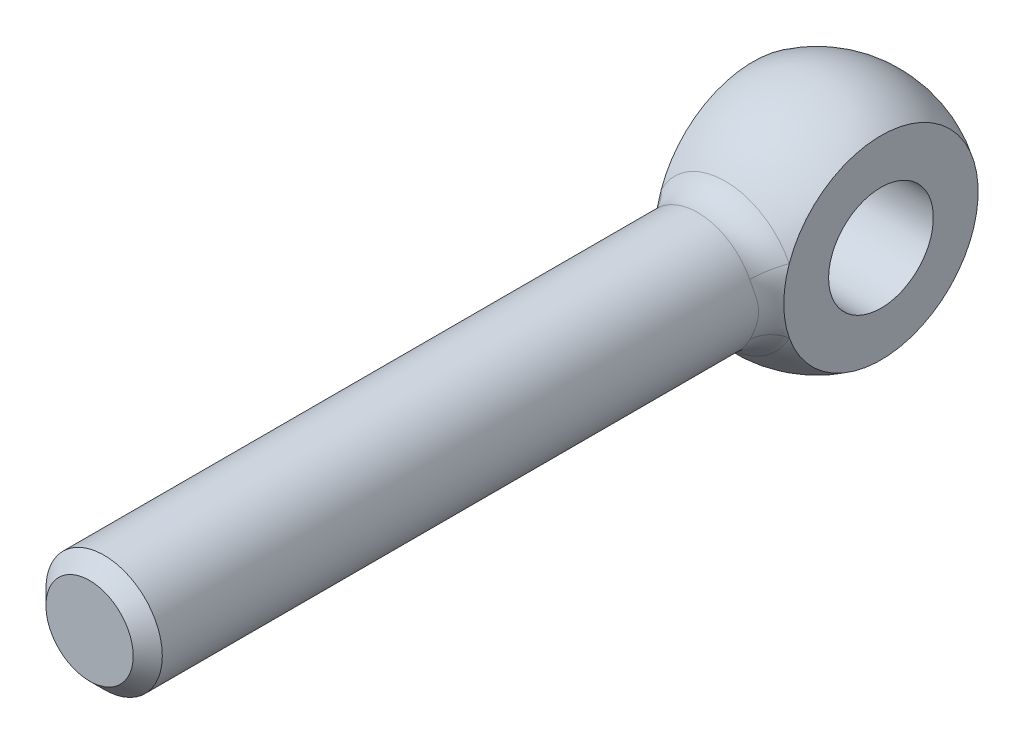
ISO-10303-21;
HEADER;
FILE_DESCRIPTION(('STEP AP214'),'2;1');
FILE_NAME('part.step','',(''),(''),'','','');
FILE_SCHEMA(('AUTOMOTIVE_DESIGN { 1 0 10303 214 1 1 1 1 }'));
ENDSEC;
DATA;
#1=APPLICATION_CONTEXT('core data for automotive mechanical design processes');
#2=APPLICATION_PROTOCOL_DEFINITION('international standard','automotive_design',2000,#1);
#3=PRODUCT_CONTEXT('',#1,'mechanical');
#4=PRODUCT('Part','Part','',(#3));
#5=PRODUCT_RELATED_PRODUCT_CATEGORY('part','',(#4));
#6=PRODUCT_DEFINITION_FORMATION('','',#4);
#7=PRODUCT_DEFINITION_CONTEXT('part definition',#1,'design');
#8=PRODUCT_DEFINITION('design','',#6,#7);
#9=PRODUCT_DEFINITION_SHAPE('','',#8);
#10=(LENGTH_UNIT() NAMED_UNIT(*) SI_UNIT(.MILLI.,.METRE.));
#11=(NAMED_UNIT(*) PLANE_ANGLE_UNIT() SI_UNIT($,.RADIAN.));
#12=(NAMED_UNIT(*) SI_UNIT($,.STERADIAN.) SOLID_ANGLE_UNIT());
#13=UNCERTAINTY_MEASURE_WITH_UNIT(LENGTH_MEASURE(1.E-05),#10,'distance_accuracy_value','');
#14=(GEOMETRIC_REPRESENTATION_CONTEXT(3) GLOBAL_UNCERTAINTY_ASSIGNED_CONTEXT((#13)) GLOBAL_UNIT_ASSIGNED_CONTEXT((#10,
#11,#12)) REPRESENTATION_CONTEXT('',''));
#15=CARTESIAN_POINT('',(0.,0.,0.));
#16=DIRECTION('',(0.,0.,1.));
#17=DIRECTION('',(1.,0.,0.));
#18=AXIS2_PLACEMENT_3D('',#15,#16,#17);
#19=CARTESIAN_POINT('',(0.,0.,0.));
#20=DIRECTION('',(-1.,0.,0.));
#21=DIRECTION('',(0.,0.,-1.));
#22=AXIS2_PLACEMENT_3D('',#19,#20,#21);
#23=SPHERICAL_SURFACE('',#22,20.);
#24=CARTESIAN_POINT('',(11.,0.,0.));
#25=DIRECTION('',(1.,0.,0.));
#26=DIRECTION('',(0.,0.,1.));
#27=AXIS2_PLACEMENT_3D('',#24,#25,#26);
#28=CIRCLE('',#27,16.70329308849);
#29=CARTESIAN_POINT('',(11.,5.52080518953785,15.7645396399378));
#30=VERTEX_POINT('',#29);
#31=CARTESIAN_POINT('',(11.,-5.52080518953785,15.7645396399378));
#32=VERTEX_POINT('',#31);
#33=EDGE_CURVE('E249',#30,#32,#28,.F.);
#34=ORIENTED_EDGE('',*,*,#33,.T.);
#35=CARTESIAN_POINT('',(0.,0.,15.7645396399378));
#36=DIRECTION('',(0.,0.,-1.));
#37=DIRECTION('',(-1.,0.,0.));
#38=AXIS2_PLACEMENT_3D('',#35,#36,#37);
#39=CIRCLE('',#38,12.3076923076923);
#40=CARTESIAN_POINT('',(-11.,-5.52080518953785,15.7645396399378));
#41=VERTEX_POINT('',#40);
#42=EDGE_CURVE('E72',#32,#41,#39,.T.);
#43=ORIENTED_EDGE('',*,*,#42,.T.);
#44=CARTESIAN_POINT('',(-11.,0.,0.));
#45=DIRECTION('',(1.,0.,0.));
#46=DIRECTION('',(0.,0.,1.));
#47=AXIS2_PLACEMENT_3D('',#44,#45,#46);
#48=CIRCLE('',#47,16.70329308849);
#49=CARTESIAN_POINT('',(-11.,5.52080518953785,15.7645396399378));
#50=VERTEX_POINT('',#49);
#51=EDGE_CURVE('E60',#50,#41,#48,.F.);
#52=ORIENTED_EDGE('',*,*,#51,.F.);
#53=CARTESIAN_POINT('',(0.,0.,15.7645396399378));
#54=DIRECTION('',(0.,0.,-1.));
#55=DIRECTION('',(-1.,0.,0.));
#56=AXIS2_PLACEMENT_3D('',#53,#54,#55);
#57=CIRCLE('',#56,12.3076923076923);
#58=EDGE_CURVE('E69',#50,#30,#57,.T.);
#59=ORIENTED_EDGE('',*,*,#58,.T.);
#60=EDGE_LOOP('',(#34,#43,#52,#59));
#61=FACE_BOUND('',#60,.T.);
#62=ADVANCED_FACE('F14',(#61),#23,.T.);
#63=CARTESIAN_POINT('',(0.,0.,-10.));
#64=DIRECTION('',(0.,0.,-1.));
#65=DIRECTION('',(1.,0.,0.));
#66=AXIS2_PLACEMENT_3D('',#63,#64,#65);
#67=CYLINDRICAL_SURFACE('',#66,10.);
#68=CARTESIAN_POINT('',(11.,8.07832617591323,14.6198716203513));
#69=CARTESIAN_POINT('',(8.08765754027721,5.99719772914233,16.1346741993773));
#70=CARTESIAN_POINT('',(7.28375150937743,6.85178545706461,19.8401938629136));
#71=CARTESIAN_POINT('',(11.,7.94371142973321,14.6942392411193));
#72=CARTESIAN_POINT('',(8.11920288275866,5.93544807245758,16.2397825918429));
#73=CARTESIAN_POINT('',(7.39683409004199,6.73162150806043,19.9238227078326));
#74=CARTESIAN_POINT('',(11.,7.80678494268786,14.7674864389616));
#75=CARTESIAN_POINT('',(8.15519367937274,5.8698319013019,16.3423149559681));
#76=CARTESIAN_POINT('',(7.50807818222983,6.60735770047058,19.9985173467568));
#77=CARTESIAN_POINT('',(11.,7.52777859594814,14.9116503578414));
#78=CARTESIAN_POINT('',(8.23492168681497,5.72986071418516,16.5404699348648));
#79=CARTESIAN_POINT('',(7.72578328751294,6.35140245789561,20.1309394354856));
#80=CARTESIAN_POINT('',(11.,7.38570047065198,14.9825678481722));
#81=CARTESIAN_POINT('',(8.27858235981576,5.65560014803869,16.6361171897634));
#82=CARTESIAN_POINT('',(7.83224588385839,6.21971351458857,20.1886725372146));
#83=CARTESIAN_POINT('',(11.,7.09641260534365,15.1217242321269));
#84=CARTESIAN_POINT('',(8.37244720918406,5.4973859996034,16.8193360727));
#85=CARTESIAN_POINT('',(8.03890108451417,5.95019585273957,20.2879075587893));
#86=CARTESIAN_POINT('',(11.,6.94922832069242,15.1899735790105));
#87=CARTESIAN_POINT('',(8.42255486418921,5.41357855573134,16.9069775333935));
#88=CARTESIAN_POINT('',(8.1391193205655,5.81239684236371,20.3294800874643));
#89=CARTESIAN_POINT('',(11.,6.64863682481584,15.3239259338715));
#90=CARTESIAN_POINT('',(8.52797993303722,5.23504745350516,17.0738797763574));
#91=CARTESIAN_POINT('',(8.33295854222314,5.53091179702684,20.3979224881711));
#92=CARTESIAN_POINT('',(11.,6.49523086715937,15.3896294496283));
#93=CARTESIAN_POINT('',(8.58324700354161,5.14042645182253,17.1531990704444));
#94=CARTESIAN_POINT('',(8.42658084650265,5.38722694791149,20.4247953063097));
#95=CARTESIAN_POINT('',(11.,6.20709411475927,15.5078088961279));
#96=CARTESIAN_POINT('',(8.68811994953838,4.95575537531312,17.2908288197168));
#97=CARTESIAN_POINT('',(8.59200338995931,5.11841729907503,20.4619167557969));
#98=CARTESIAN_POINT('',(11.,6.07336532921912,15.5607030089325));
#99=CARTESIAN_POINT('',(8.73711538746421,4.86761224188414,17.3504312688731));
#100=CARTESIAN_POINT('',(8.66488139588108,4.99405789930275,20.4741536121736));
#101=CARTESIAN_POINT('',(11.,5.80091130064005,15.6643118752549));
#102=CARTESIAN_POINT('',(8.83647568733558,4.68301353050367,17.4631108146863));
#103=CARTESIAN_POINT('',(8.80526889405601,4.74215537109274,20.4901477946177));
#104=CARTESIAN_POINT('',(11.,5.66218619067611,15.7150266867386));
#105=CARTESIAN_POINT('',(8.88683503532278,4.58660687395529,17.5162358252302));
#106=CARTESIAN_POINT('',(8.87277852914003,4.61461232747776,20.4939053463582));
#107=CARTESIAN_POINT('',(11.,5.2744874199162,15.8508024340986));
#108=CARTESIAN_POINT('',(9.02498244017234,4.31134076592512,17.6524759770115));
#109=CARTESIAN_POINT('',(9.05025948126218,4.26097993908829,20.4938948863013));
#110=CARTESIAN_POINT('',(11.,5.02010807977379,15.933417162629));
#111=CARTESIAN_POINT('',(9.1134168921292,4.12339116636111,17.7293699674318));
#112=CARTESIAN_POINT('',(9.15455589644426,4.03201043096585,20.482471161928));
#113=CARTESIAN_POINT('',(11.,4.49398867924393,16.0897301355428));
#114=CARTESIAN_POINT('',(9.2852606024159,3.7225223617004,17.8631716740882));
#115=CARTESIAN_POINT('',(9.3454636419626,3.56728408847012,20.4426249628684));
#116=CARTESIAN_POINT('',(11.,4.22223625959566,16.1634219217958));
#117=CARTESIAN_POINT('',(9.36879764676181,3.50966167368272,17.9203351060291));
#118=CARTESIAN_POINT('',(9.43206219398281,3.33152248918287,20.4141902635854));
#119=CARTESIAN_POINT('',(11.,3.65988605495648,16.2999751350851));
#120=CARTESIAN_POINT('',(9.52556401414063,3.06031940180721,18.0164117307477));
#121=CARTESIAN_POINT('',(9.58737307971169,2.8540318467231,20.3472388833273));
#122=CARTESIAN_POINT('',(11.,3.36923757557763,16.3628056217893));
#123=CARTESIAN_POINT('',(9.59896836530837,2.82367795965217,18.055508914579));
#124=CARTESIAN_POINT('',(9.65603459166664,2.61228792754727,20.3086941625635));
#125=CARTESIAN_POINT('',(11.,2.76973253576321,16.47487160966));
#126=CARTESIAN_POINT('',(9.7303273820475,2.33005694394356,18.1181298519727));
#127=CARTESIAN_POINT('',(9.77497001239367,2.12438390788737,20.2300406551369));
#128=CARTESIAN_POINT('',(11.,2.46087520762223,16.5241065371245));
#129=CARTESIAN_POINT('',(9.78851479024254,2.07279105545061,18.1418261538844));
#130=CARTESIAN_POINT('',(9.82524314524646,1.87822362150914,20.1899318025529));
#131=CARTESIAN_POINT('',(11.,1.97558099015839,16.5869215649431));
#132=CARTESIAN_POINT('',(9.8627242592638,1.66606653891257,18.1691299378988));
#133=CARTESIAN_POINT('',(9.88798469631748,1.49853407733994,20.1346921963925));
#134=CARTESIAN_POINT('',(11.,1.80486836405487,16.6064011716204));
#135=CARTESIAN_POINT('',(9.88572783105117,1.52271728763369,18.1769526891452));
#136=CARTESIAN_POINT('',(9.90713175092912,1.36624599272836,20.1166604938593));
#137=CARTESIAN_POINT('',(11.,1.45962748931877,16.6402989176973));
#138=CARTESIAN_POINT('',(9.92572316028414,1.2323607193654,18.1898667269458));
#139=CARTESIAN_POINT('',(9.94012224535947,1.1008390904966,20.0843097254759));
#140=CARTESIAN_POINT('',(11.,1.28509972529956,16.6547176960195));
#141=CARTESIAN_POINT('',(9.94274289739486,1.08526382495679,18.194968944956));
#142=CARTESIAN_POINT('',(9.95396635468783,0.967720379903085,20.0699901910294));
#143=CARTESIAN_POINT('',(11.,0.933265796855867,16.6781317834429));
#144=CARTESIAN_POINT('',(9.97034914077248,0.788518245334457,18.2029399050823));
#145=CARTESIAN_POINT('',(9.97630347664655,0.70091512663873,20.0463030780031));
#146=CARTESIAN_POINT('',(11.,0.755960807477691,16.6871293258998));
#147=CARTESIAN_POINT('',(9.98095837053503,0.638767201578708,18.2058159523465));
#148=CARTESIAN_POINT('',(9.98479869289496,0.567228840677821,20.0369334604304));
#149=CARTESIAN_POINT('',(11.,0.399779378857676,16.6994587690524));
#150=CARTESIAN_POINT('',(9.99548246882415,0.337908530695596,18.20969285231));
#151=CARTESIAN_POINT('',(9.99641148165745,0.299512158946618,20.024007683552));
#152=CARTESIAN_POINT('',(11.,0.220902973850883,16.7027907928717));
#153=CARTESIAN_POINT('',(9.99940850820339,0.186688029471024,18.2106967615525));
#154=CARTESIAN_POINT('',(9.99952917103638,0.165481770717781,20.0204513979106));
#155=CARTESIAN_POINT('',(11.,-0.136946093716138,16.7036898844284));
#156=CARTESIAN_POINT('',(10.0004672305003,-0.115727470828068,18.2109707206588));
#157=CARTESIAN_POINT('',(10.0003719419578,-0.102589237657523,20.0194964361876));
#158=CARTESIAN_POINT('',(11.,-0.315918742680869,16.7012576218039));
#159=CARTESIAN_POINT('',(9.99760151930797,-0.26703906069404,18.2102411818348));
#160=CARTESIAN_POINT('',(9.9980976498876,-0.236629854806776,20.0220970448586));
#161=CARTESIAN_POINT('',(11.,-0.672512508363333,16.6907025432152));
#162=CARTESIAN_POINT('',(9.98516890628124,-0.568286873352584,18.2069499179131));
#163=CARTESIAN_POINT('',(9.98816894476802,-0.504415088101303,20.0332017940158));
#164=CARTESIAN_POINT('',(11.,-0.850133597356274,16.6825796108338));
#165=CARTESIAN_POINT('',(9.97559239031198,-0.718336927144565,18.2043856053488));
#166=CARTESIAN_POINT('',(9.98051442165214,-0.638159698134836,20.0417060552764));
#167=CARTESIAN_POINT('',(11.,-1.20278271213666,16.6608685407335));
#168=CARTESIAN_POINT('',(9.94999783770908,-1.01586252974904,18.1971047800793));
#169=CARTESIAN_POINT('',(9.95985376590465,-0.905121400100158,20.063826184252));
#170=CARTESIAN_POINT('',(11.,-1.37780963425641,16.6472781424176));
#171=CARTESIAN_POINT('',(9.93395835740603,-1.16344227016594,18.1923815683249));
#172=CARTESIAN_POINT('',(9.94684541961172,-1.03833825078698,20.0774441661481));
#173=CARTESIAN_POINT('',(11.,-1.72418294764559,16.6149773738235));
#174=CARTESIAN_POINT('',(9.89585032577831,-1.45491369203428,18.1803094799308));
#175=CARTESIAN_POINT('',(9.91552061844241,-1.3039715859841,20.1086007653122));
#176=CARTESIAN_POINT('',(11.,-1.89552887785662,16.5962663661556));
#177=CARTESIAN_POINT('',(9.87375477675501,-1.59889725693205,18.1729504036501));
#178=CARTESIAN_POINT('',(9.89720350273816,-1.43638796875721,20.1261398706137));
#179=CARTESIAN_POINT('',(11.,-2.37500909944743,16.5365375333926));
#180=CARTESIAN_POINT('',(9.80319058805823,-2.00106700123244,18.1475319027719));
#181=CARTESIAN_POINT('',(9.83780774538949,-1.81042123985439,20.1794292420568));
#182=CARTESIAN_POINT('',(11.,-2.6779072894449,16.4899385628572));
#183=CARTESIAN_POINT('',(9.74810406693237,-2.25372442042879,18.1256509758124));
#184=CARTESIAN_POINT('',(9.79049373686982,-2.0509057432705,20.2181580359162));
#185=CARTESIAN_POINT('',(11.,-3.26643445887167,16.3835279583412));
#186=CARTESIAN_POINT('',(9.62321822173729,-2.7394442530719,18.0677502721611));
#187=CARTESIAN_POINT('',(9.67835774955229,-2.52772088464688,20.2950790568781));
#188=CARTESIAN_POINT('',(11.,-3.55206644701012,16.3237186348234));
#189=CARTESIAN_POINT('',(9.55320446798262,-2.97279590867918,18.0315791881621));
#190=CARTESIAN_POINT('',(9.61353883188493,-2.7640522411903,20.333271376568));
#191=CARTESIAN_POINT('',(11.,-4.10520079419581,16.1934500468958));
#192=CARTESIAN_POINT('',(9.40307308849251,-3.41694854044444,17.9425152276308));
#193=CARTESIAN_POINT('',(9.46676566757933,-3.23111087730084,20.4009956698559));
#194=CARTESIAN_POINT('',(11.,-4.37275328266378,16.1230221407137));
#195=CARTESIAN_POINT('',(9.32279049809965,-3.6279239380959,17.8894603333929));
#196=CARTESIAN_POINT('',(9.38486161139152,-3.4618524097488,20.430552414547));
#197=CARTESIAN_POINT('',(11.,-4.89128593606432,15.9733573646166));
#198=CARTESIAN_POINT('',(9.15681833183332,-4.02651224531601,17.7649594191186));
#199=CARTESIAN_POINT('',(9.20410009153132,-3.91720598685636,20.4744658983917));
#200=CARTESIAN_POINT('',(11.,-5.14226890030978,15.8941219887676));
#201=CARTESIAN_POINT('',(9.07099592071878,-4.21407941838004,17.6932699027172));
#202=CARTESIAN_POINT('',(9.10524550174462,-4.14181906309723,20.4888252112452));
#203=CARTESIAN_POINT('',(11.,-5.57948076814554,15.7452016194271));
#204=CARTESIAN_POINT('',(8.91675575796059,-4.52930004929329,17.5476124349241));
#205=CARTESIAN_POINT('',(8.91288683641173,-4.53858237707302,20.4959451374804));
#206=CARTESIAN_POINT('',(11.,-5.76853191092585,15.6768309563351));
#207=CARTESIAN_POINT('',(8.84816828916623,-4.66157604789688,17.4767712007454));
#208=CARTESIAN_POINT('',(8.82235160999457,-4.71214727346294,20.4924900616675));
#209=CARTESIAN_POINT('',(11.,-6.13738931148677,15.5361317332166));
#210=CARTESIAN_POINT('',(8.71360068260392,-4.91098552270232,17.3233243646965));
#211=CARTESIAN_POINT('',(8.63145758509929,-5.05332990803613,20.4699143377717));
#212=CARTESIAN_POINT('',(11.,-6.31719880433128,15.4638045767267));
#213=CARTESIAN_POINT('',(8.64763428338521,-5.02800230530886,17.2406040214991));
#214=CARTESIAN_POINT('',(8.53110226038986,-5.2209497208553,20.4507992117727));
#215=CARTESIAN_POINT('',(11.,-6.67039350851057,15.3147992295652));
#216=CARTESIAN_POINT('',(8.52017906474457,-5.24885941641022,17.062956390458));
#217=CARTESIAN_POINT('',(8.32005997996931,-5.55115938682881,20.3943977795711));
#218=CARTESIAN_POINT('',(11.,-6.84367796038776,15.2380797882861));
#219=CARTESIAN_POINT('',(8.45881409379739,-5.35236860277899,16.967804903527));
#220=CARTESIAN_POINT('',(8.20926514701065,-5.71366661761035,20.3568998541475));
#221=CARTESIAN_POINT('',(11.,-7.18254092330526,15.0813064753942));
#222=CARTESIAN_POINT('',(8.34361214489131,-5.54600465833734,16.7669351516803));
#223=CARTESIAN_POINT('',(7.97938823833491,-6.03058739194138,20.2617246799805));
#224=CARTESIAN_POINT('',(11.,-7.34810983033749,15.0012486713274));
#225=CARTESIAN_POINT('',(8.28987110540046,-5.63596246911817,16.6611306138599));
#226=CARTESIAN_POINT('',(7.86029627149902,-6.18499087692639,20.2040230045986));
#227=CARTESIAN_POINT('',(11.,-7.51010721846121,14.919728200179));
#228=CARTESIAN_POINT('',(8.24137694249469,-5.71943183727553,16.5511784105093));
#229=CARTESIAN_POINT('',(7.73770382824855,-6.3346617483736,20.1353038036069));
#230=(BOUNDED_SURFACE() B_SPLINE_SURFACE(3,2,((#68,#69,#70),(#71,#72,#73),(#74,#75,#76),(#77,
#78,#79),(#80,#81,#82),(#83,#84,#85),(#86,#87,#88),(#89,#90,#91),(#92,#93,#94),(#95,#96,#97),
(#98,#99,#100),(#101,#102,#103),(#104,#105,#106),(#107,#108,#109),(#110,#111,#112),(#113,#114,
#115),(#116,#117,#118),(#119,#120,#121),(#122,#123,#124),(#125,#126,#127),(#128,#129,#130),
(#131,#132,#133),(#134,#135,#136),(#137,#138,#139),(#140,#141,#142),(#143,#144,#145),(#146,#147,
#148),(#149,#150,#151),(#152,#153,#154),(#155,#156,#157),(#158,#159,#160),(#161,#162,#163),
(#164,#165,#166),(#167,#168,#169),(#170,#171,#172),(#173,#174,#175),(#176,#177,#178),(#179,#180,
#181),(#182,#183,#184),(#185,#186,#187),(#188,#189,#190),(#191,#192,#193),(#194,#195,#196),
(#197,#198,#199),(#200,#201,#202),(#203,#204,#205),(#206,#207,#208),(#209,#210,#211),(#212,#213,
#214),(#215,#216,#217),(#218,#219,#220),(#221,#222,#223),(#224,#225,#226),(#227,#228,#229)),
.UNSPECIFIED.,.F.,.F.,.F.) B_SPLINE_SURFACE_WITH_KNOTS((4,2,2,2,2,2,2,2,2,2,2,2,2,2,2,2,2,2,2,2,
2,2,2,2,2,2,4),(3,3),(0.,0.830487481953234,1.66069791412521,2.48723908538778,3.31361454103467,
4.00607990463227,4.69852683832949,5.90492644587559,7.11219405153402,8.32284604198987,
9.53354911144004,10.1772580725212,10.8208857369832,11.4642480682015,12.1075964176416,
12.7508700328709,13.3941568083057,14.0377098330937,14.6813430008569,15.8623569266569,
17.043164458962,18.2205508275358,19.3977377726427,20.336589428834,21.2751101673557,
22.224698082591,23.1754380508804),(0.,1.),
.UNSPECIFIED.) GEOMETRIC_REPRESENTATION_ITEM() RATIONAL_B_SPLINE_SURFACE(((1.,0.839284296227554,
1.),(1.,0.842507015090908,1.),(1.,0.845813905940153,1.),(1.,0.852563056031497,1.),(1.,
0.85600526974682,1.),(1.,0.862978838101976,1.),(1.,0.86650973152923,1.),(1.,0.873627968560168,
1.),(1.,0.877215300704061,1.),(1.,0.883811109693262,1.),(1.,0.886819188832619,1.),(1.,
0.892802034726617,1.),(1.,0.895776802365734,1.),(1.,0.903839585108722,1.),(1.,0.908857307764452,
1.),(1.,0.918479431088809,1.),(1.,0.923083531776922,1.),(1.,0.931678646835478,1.),(1.,
0.935667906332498,1.),(1.,0.942805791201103,1.),(1.,0.94595438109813,1.),(1.,0.949974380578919,
1.),(1.,0.95122168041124,1.),(1.,0.953392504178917,1.),(1.,0.954316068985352,1.),(1.,
0.955815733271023,1.),(1.,0.956391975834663,1.),(1.,0.957181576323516,1.),(1.,0.957394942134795,
1.),(1.,0.957452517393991,1.),(1.,0.957296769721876,1.),(1.,0.956620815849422,1.),(1.,
0.95610060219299,1.),(1.,0.954710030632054,1.),(1.,0.953839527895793,1.),(1.,0.951770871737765,
1.),(1.,0.950572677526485,1.),(1.,0.946749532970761,1.),(1.,0.943768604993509,1.),(1.,
0.936985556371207,1.),(1.,0.933183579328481,1.),(1.,0.924966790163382,1.),(1.,0.920553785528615,
1.),(1.,0.911300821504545,1.),(1.,0.906460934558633,1.),(1.,0.897549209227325,1.),(1.,
0.893520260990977,1.),(1.,0.885405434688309,1.),(1.,0.881319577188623,1.),(1.,0.873128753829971,
1.),(1.,0.869024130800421,1.),(1.,0.860913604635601,1.),(1.,0.856907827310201,1.),(1.,
0.852991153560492,1.))) REPRESENTATION_ITEM('') SURFACE());
#231=CARTESIAN_POINT('',(7.73770382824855,-6.3346617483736,20.1353038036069));
#232=CARTESIAN_POINT('',(7.86029627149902,-6.18499087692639,20.2040230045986));
#233=CARTESIAN_POINT('',(7.97938823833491,-6.03058739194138,20.2617246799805));
#234=CARTESIAN_POINT('',(8.20926514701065,-5.71366661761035,20.3568998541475));
#235=CARTESIAN_POINT('',(8.32005997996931,-5.55115938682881,20.3943977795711));
#236=CARTESIAN_POINT('',(8.53110226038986,-5.2209497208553,20.4507992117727));
#237=CARTESIAN_POINT('',(8.63145758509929,-5.05332990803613,20.4699143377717));
#238=CARTESIAN_POINT('',(8.82235160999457,-4.71214727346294,20.4924900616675));
#239=CARTESIAN_POINT('',(8.91288683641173,-4.53858237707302,20.4959451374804));
#240=CARTESIAN_POINT('',(9.10524550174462,-4.14181906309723,20.4888252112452));
#241=CARTESIAN_POINT('',(9.20410009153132,-3.91720598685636,20.4744658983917));
#242=CARTESIAN_POINT('',(9.38486161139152,-3.4618524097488,20.430552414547));
#243=CARTESIAN_POINT('',(9.46676566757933,-3.23111087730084,20.4009956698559));
#244=CARTESIAN_POINT('',(9.61353883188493,-2.7640522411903,20.333271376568));
#245=CARTESIAN_POINT('',(9.67835774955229,-2.52772088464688,20.2950790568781));
#246=CARTESIAN_POINT('',(9.79049373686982,-2.0509057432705,20.2181580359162));
#247=CARTESIAN_POINT('',(9.83780774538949,-1.81042123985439,20.1794292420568));
#248=CARTESIAN_POINT('',(9.89720350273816,-1.43638796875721,20.1261398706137));
#249=CARTESIAN_POINT('',(9.91552061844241,-1.3039715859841,20.1086007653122));
#250=CARTESIAN_POINT('',(9.94684541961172,-1.03833825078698,20.0774441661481));
#251=CARTESIAN_POINT('',(9.95985376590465,-0.905121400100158,20.063826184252));
#252=CARTESIAN_POINT('',(9.98051442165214,-0.638159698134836,20.0417060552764));
#253=CARTESIAN_POINT('',(9.98816894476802,-0.504415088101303,20.0332017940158));
#254=CARTESIAN_POINT('',(9.9980976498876,-0.236629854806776,20.0220970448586));
#255=CARTESIAN_POINT('',(10.0003719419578,-0.102589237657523,20.0194964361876));
#256=CARTESIAN_POINT('',(9.99952917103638,0.165481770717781,20.0204513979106));
#257=CARTESIAN_POINT('',(9.99641148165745,0.299512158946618,20.024007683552));
#258=CARTESIAN_POINT('',(9.98479869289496,0.567228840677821,20.0369334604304));
#259=CARTESIAN_POINT('',(9.97630347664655,0.70091512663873,20.0463030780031));
#260=CARTESIAN_POINT('',(9.95396635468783,0.967720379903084,20.0699901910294));
#261=CARTESIAN_POINT('',(9.94012224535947,1.1008390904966,20.0843097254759));
#262=CARTESIAN_POINT('',(9.90713175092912,1.36624599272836,20.1166604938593));
#263=CARTESIAN_POINT('',(9.88798469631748,1.49853407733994,20.1346921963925));
#264=CARTESIAN_POINT('',(9.82524314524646,1.87822362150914,20.1899318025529));
#265=CARTESIAN_POINT('',(9.77497001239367,2.12438390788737,20.2300406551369));
#266=CARTESIAN_POINT('',(9.65603459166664,2.61228792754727,20.3086941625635));
#267=CARTESIAN_POINT('',(9.58737307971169,2.8540318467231,20.3472388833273));
#268=CARTESIAN_POINT('',(9.43206219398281,3.33152248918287,20.4141902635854));
#269=CARTESIAN_POINT('',(9.3454636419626,3.56728408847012,20.4426249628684));
#270=CARTESIAN_POINT('',(9.15455589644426,4.03201043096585,20.482471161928));
#271=CARTESIAN_POINT('',(9.05025948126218,4.26097993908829,20.4938948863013));
#272=CARTESIAN_POINT('',(8.87277852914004,4.61461232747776,20.4939053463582));
#273=CARTESIAN_POINT('',(8.80526889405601,4.74215537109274,20.4901477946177));
#274=CARTESIAN_POINT('',(8.66488139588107,4.99405789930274,20.4741536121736));
#275=CARTESIAN_POINT('',(8.59200338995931,5.11841729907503,20.4619167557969));
#276=CARTESIAN_POINT('',(8.42658084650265,5.38722694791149,20.4247953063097));
#277=CARTESIAN_POINT('',(8.33295854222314,5.53091179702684,20.3979224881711));
#278=CARTESIAN_POINT('',(8.1391193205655,5.81239684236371,20.3294800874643));
#279=CARTESIAN_POINT('',(8.03890108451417,5.95019585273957,20.2879075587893));
#280=CARTESIAN_POINT('',(7.83224588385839,6.21971351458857,20.1886725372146));
#281=CARTESIAN_POINT('',(7.72578328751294,6.35140245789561,20.1309394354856));
#282=CARTESIAN_POINT('',(7.50807818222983,6.60735770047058,19.9985173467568));
#283=CARTESIAN_POINT('',(7.39683409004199,6.73162150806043,19.9238227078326));
#284=CARTESIAN_POINT('',(7.28375150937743,6.85178545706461,19.8401938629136));
#285=B_SPLINE_CURVE_WITH_KNOTS('',3,(#231,#232,#233,#234,#235,#236,#237,#238,#239,#240,#241,
#242,#243,#244,#245,#246,#247,#248,#249,#250,#251,#252,#253,#254,#255,#256,#257,#258,#259,#260,
#261,#262,#263,#264,#265,#266,#267,#268,#269,#270,#271,#272,#273,#274,#275,#276,#277,#278,#279,
#280,#281,#282,#283,#284),.UNSPECIFIED.,.F.,.F.,(4,2,2,2,2,2,2,2,2,2,2,2,2,2,2,2,2,2,2,2,2,2,2,
2,2,2,4),(0.,0.950739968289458,1.90032788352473,2.8388486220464,3.77770027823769,
4.95488722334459,6.13227359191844,7.31308112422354,8.49409505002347,9.13772821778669,
9.7812812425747,10.4245680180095,11.0678416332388,11.711189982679,12.3545523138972,
12.9981799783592,13.6418889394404,14.8525920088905,16.0632439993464,17.2705116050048,
18.4769112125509,19.1693581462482,19.8618235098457,20.6881989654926,21.5147401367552,
22.3449505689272,23.1754380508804),.UNSPECIFIED.);
#286=CARTESIAN_POINT('',(8.9375,-4.4856542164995,20.4939015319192));
#287=VERTEX_POINT('',#286);
#288=CARTESIAN_POINT('',(8.9375,4.48565421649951,20.4939015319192));
#289=VERTEX_POINT('',#288);
#290=EDGE_CURVE('E85',#287,#289,#285,.T.);
#291=ORIENTED_EDGE('',*,*,#290,.T.);
#292=CARTESIAN_POINT('',(0.,0.,20.4939015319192));
#293=DIRECTION('',(0.,0.,-1.));
#294=DIRECTION('',(-1.,0.,0.));
#295=AXIS2_PLACEMENT_3D('',#292,#293,#294);
#296=CIRCLE('',#295,10.);
#297=CARTESIAN_POINT('',(-8.9375,4.4856542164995,20.4939015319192));
#298=VERTEX_POINT('',#297);
#299=EDGE_CURVE('E9',#289,#298,#296,.F.);
#300=ORIENTED_EDGE('',*,*,#299,.T.);
#301=CARTESIAN_POINT('',(-11.,-8.07832621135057,14.6198716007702));
#302=CARTESIAN_POINT('',(-8.08765753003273,-5.9971977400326,16.1346741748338));
#303=CARTESIAN_POINT('',(-7.28375150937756,-6.85178545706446,19.8401938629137));
#304=CARTESIAN_POINT('',(-11.,-7.94371144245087,14.6942392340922));
#305=CARTESIAN_POINT('',(-8.11920287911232,-5.93544807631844,16.2397825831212));
#306=CARTESIAN_POINT('',(-7.39683409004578,-6.73162150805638,19.9238227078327));
#307=CARTESIAN_POINT('',(-11.,-7.80678494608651,14.7674864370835));
#308=CARTESIAN_POINT('',(-8.15519367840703,-5.86983190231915,16.3423149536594));
#309=CARTESIAN_POINT('',(-7.50807818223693,-6.60735770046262,19.9985173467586));
#310=CARTESIAN_POINT('',(-11.,-7.52777859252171,14.9116503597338));
#311=CARTESIAN_POINT('',(-8.23492168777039,-5.72986071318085,16.5404699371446));
#312=CARTESIAN_POINT('',(-7.72578328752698,-6.35140245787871,20.1309394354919));
#313=CARTESIAN_POINT('',(-11.,-7.38570046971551,14.9825678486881));
#314=CARTESIAN_POINT('',(-8.27858236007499,-5.65560014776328,16.6361171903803));
#315=CARTESIAN_POINT('',(-7.83224588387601,-6.21971351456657,20.1886725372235));
#316=CARTESIAN_POINT('',(-11.,-7.09641260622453,15.121724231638));
#317=CARTESIAN_POINT('',(-8.37244720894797,-5.49738599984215,16.8193360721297));
#318=CARTESIAN_POINT('',(-8.03890108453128,-5.9501958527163,20.2879075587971));
#319=CARTESIAN_POINT('',(-11.,-6.94922832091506,15.1899735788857));
#320=CARTESIAN_POINT('',(-8.42255486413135,-5.41357855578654,16.9069775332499));
#321=CARTESIAN_POINT('',(-8.13911932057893,-5.81239684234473,20.3294800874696));
#322=CARTESIAN_POINT('',(-11.,-6.6486368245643,15.3239259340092));
#323=CARTESIAN_POINT('',(-8.52797993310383,-5.23504745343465,17.0738797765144));
#324=CARTESIAN_POINT('',(-8.33295854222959,-5.53091179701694,20.3979224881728));
#325=CARTESIAN_POINT('',(-11.,-6.49523086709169,15.3896294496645));
#326=CARTESIAN_POINT('',(-8.58324700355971,-5.14042645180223,17.1531990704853));
#327=CARTESIAN_POINT('',(-8.42658084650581,-5.38722694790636,20.4247953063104));
#328=CARTESIAN_POINT('',(-11.,-6.20709411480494,15.5078088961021));
#329=CARTESIAN_POINT('',(-8.68811994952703,-4.95575537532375,17.290828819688));
#330=CARTESIAN_POINT('',(-8.5920033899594,-5.11841729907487,20.4619167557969));
#331=CARTESIAN_POINT('',(-11.,-6.0733653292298,15.5607030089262));
#332=CARTESIAN_POINT('',(-8.73711538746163,-4.86761224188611,17.350431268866));
#333=CARTESIAN_POINT('',(-8.66488139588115,-4.99405789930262,20.4741536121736));
#334=CARTESIAN_POINT('',(-11.,-5.80091130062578,15.6643118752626));
#335=CARTESIAN_POINT('',(-8.83647568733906,-4.68301353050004,17.4631108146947));
#336=CARTESIAN_POINT('',(-8.80526889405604,-4.74215537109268,20.4901477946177));
#337=CARTESIAN_POINT('',(-11.,-5.66218619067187,15.7150266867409));
#338=CARTESIAN_POINT('',(-8.8868350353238,-4.58660687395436,17.5162358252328));
#339=CARTESIAN_POINT('',(-8.87277852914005,-4.61461232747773,20.4939053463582));
#340=CARTESIAN_POINT('',(-11.,-5.27448741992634,15.8508024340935));
#341=CARTESIAN_POINT('',(-9.02498244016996,-4.31134076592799,17.6524759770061));
#342=CARTESIAN_POINT('',(-9.05025948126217,-4.26097993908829,20.4938948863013));
#343=CARTESIAN_POINT('',(-11.,-5.02010807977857,15.933417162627));
#344=CARTESIAN_POINT('',(-9.11341689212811,-4.12339116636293,17.7293699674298));
#345=CARTESIAN_POINT('',(-9.15455589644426,-4.03201043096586,20.482471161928));
#346=CARTESIAN_POINT('',(-11.,-4.49398867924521,16.089730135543));
#347=CARTESIAN_POINT('',(-9.28526060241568,-3.72252236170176,17.8631716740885));
#348=CARTESIAN_POINT('',(-9.3454636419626,-3.56728408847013,20.4426249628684));
#349=CARTESIAN_POINT('',(-11.,-4.22223625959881,16.1634219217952));
#350=CARTESIAN_POINT('',(-9.36879764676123,-3.50966167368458,17.9203351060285));
#351=CARTESIAN_POINT('',(-9.43206219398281,-3.33152248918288,20.4141902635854));
#352=CARTESIAN_POINT('',(-11.,-3.65988605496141,16.2999751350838));
#353=CARTESIAN_POINT('',(-9.52556401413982,-3.06031940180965,18.0164117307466));
#354=CARTESIAN_POINT('',(-9.58737307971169,-2.85403184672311,20.3472388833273));
#355=CARTESIAN_POINT('',(-11.,-3.36923757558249,16.3628056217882));
#356=CARTESIAN_POINT('',(-9.59896836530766,-2.82367795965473,18.0555089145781));
#357=CARTESIAN_POINT('',(-9.65603459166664,-2.61228792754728,20.3086941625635));
#358=CARTESIAN_POINT('',(-11.,-2.76973253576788,16.4748716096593));
#359=CARTESIAN_POINT('',(-9.73032738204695,-2.33005694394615,18.1181298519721));
#360=CARTESIAN_POINT('',(-9.77497001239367,-2.12438390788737,20.2300406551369));
#361=CARTESIAN_POINT('',(-11.,-2.46087520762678,16.5241065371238));
#362=CARTESIAN_POINT('',(-9.78851479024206,-2.07279105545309,18.1418261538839));
#363=CARTESIAN_POINT('',(-9.82524314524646,-1.87822362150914,20.1899318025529));
#364=CARTESIAN_POINT('',(-11.,-1.97558099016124,16.5869215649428));
#365=CARTESIAN_POINT('',(-9.86272425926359,-1.66606653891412,18.1691299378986));
#366=CARTESIAN_POINT('',(-9.88798469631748,-1.49853407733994,20.1346921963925));
#367=CARTESIAN_POINT('',(-11.,-1.80486836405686,16.6064011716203));
#368=CARTESIAN_POINT('',(-9.88572783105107,-1.52271728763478,18.176952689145));
#369=CARTESIAN_POINT('',(-9.90713175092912,-1.36624599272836,20.1166604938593));
#370=CARTESIAN_POINT('',(-11.,-1.45962748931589,16.6402989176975));
#371=CARTESIAN_POINT('',(-9.9257231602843,-1.23236071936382,18.189866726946));
#372=CARTESIAN_POINT('',(-9.94012224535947,-1.10083909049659,20.0843097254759));
#373=CARTESIAN_POINT('',(-11.,-1.28509972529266,16.6547176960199));
#374=CARTESIAN_POINT('',(-9.94274289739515,-1.08526382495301,18.1949689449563));
#375=CARTESIAN_POINT('',(-9.95396635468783,-0.967720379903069,20.0699901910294));
#376=CARTESIAN_POINT('',(-11.,-0.933265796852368,16.6781317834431));
#377=CARTESIAN_POINT('',(-9.97034914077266,-0.788518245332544,18.2029399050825));
#378=CARTESIAN_POINT('',(-9.97630347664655,-0.700915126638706,20.0463030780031));
#379=CARTESIAN_POINT('',(-11.,-0.755960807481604,16.6871293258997));
#380=CARTESIAN_POINT('',(-9.98095837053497,-0.638767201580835,18.2058159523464));
#381=CARTESIAN_POINT('',(-9.98479869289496,-0.567228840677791,20.0369334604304));
#382=CARTESIAN_POINT('',(-11.,-0.399779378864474,16.6994587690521));
#383=CARTESIAN_POINT('',(-9.99548246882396,-0.337908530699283,18.2096928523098));
#384=CARTESIAN_POINT('',(-9.99641148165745,-0.29951215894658,20.024007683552));
#385=CARTESIAN_POINT('',(-11.,-0.220902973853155,16.7027907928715));
#386=CARTESIAN_POINT('',(-9.99940850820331,-0.186688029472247,18.2106967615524));
#387=CARTESIAN_POINT('',(-9.99952917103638,-0.165481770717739,20.0204513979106));
#388=CARTESIAN_POINT('',(-11.,0.136946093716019,16.7036898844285));
#389=CARTESIAN_POINT('',(-10.0004672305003,0.115727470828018,18.2109707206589));
#390=CARTESIAN_POINT('',(-10.0003719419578,0.102589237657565,20.0194964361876));
#391=CARTESIAN_POINT('',(-11.,0.315918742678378,16.701257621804));
#392=CARTESIAN_POINT('',(-9.99760151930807,0.267039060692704,18.2102411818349));
#393=CARTESIAN_POINT('',(-9.9980976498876,0.236629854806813,20.0220970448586));
#394=CARTESIAN_POINT('',(-11.,0.672512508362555,16.6907025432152));
#395=CARTESIAN_POINT('',(-9.98516890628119,0.568286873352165,18.206949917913));
#396=CARTESIAN_POINT('',(-9.98816894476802,0.504415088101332,20.0332017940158));
#397=CARTESIAN_POINT('',(-11.,0.850133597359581,16.6825796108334));
#398=CARTESIAN_POINT('',(-9.97559239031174,0.718336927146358,18.2043856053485));
#399=CARTESIAN_POINT('',(-9.98051442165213,0.638159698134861,20.0417060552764));
#400=CARTESIAN_POINT('',(-11.,1.20278271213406,16.6608685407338));
#401=CARTESIAN_POINT('',(-9.94999783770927,1.01586252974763,18.1971047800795));
#402=CARTESIAN_POINT('',(-9.95985376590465,0.905121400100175,20.063826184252));
#403=CARTESIAN_POINT('',(-11.,1.3778096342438,16.6472781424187));
#404=CARTESIAN_POINT('',(-9.93395835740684,1.16344227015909,18.1923815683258));
#405=CARTESIAN_POINT('',(-9.94684541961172,1.03833825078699,20.0774441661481));
#406=CARTESIAN_POINT('',(-11.,1.72418294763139,16.6149773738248));
#407=CARTESIAN_POINT('',(-9.89585032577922,1.45491369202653,18.1803094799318));
#408=CARTESIAN_POINT('',(-9.91552061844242,1.3039715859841,20.1086007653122));
#409=CARTESIAN_POINT('',(-11.,1.89552887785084,16.5962663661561));
#410=CARTESIAN_POINT('',(-9.87375477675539,1.59889725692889,18.1729504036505));
#411=CARTESIAN_POINT('',(-9.89720350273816,1.43638796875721,20.1261398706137));
#412=CARTESIAN_POINT('',(-11.,2.37500909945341,16.5365375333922));
#413=CARTESIAN_POINT('',(-9.80319058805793,2.00106700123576,18.1475319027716));
#414=CARTESIAN_POINT('',(-9.83780774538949,1.81042123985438,20.1794292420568));
#415=CARTESIAN_POINT('',(-11.,2.67790728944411,16.4899385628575));
#416=CARTESIAN_POINT('',(-9.74810406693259,2.25372442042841,18.1256509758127));
#417=CARTESIAN_POINT('',(-9.79049373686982,2.05090574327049,20.2181580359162));
#418=CARTESIAN_POINT('',(-11.,3.26643445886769,16.3835279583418));
#419=CARTESIAN_POINT('',(-9.62321822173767,2.73944425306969,18.0677502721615));
#420=CARTESIAN_POINT('',(-9.67835774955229,2.52772088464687,20.2950790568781));
#421=CARTESIAN_POINT('',(-11.,3.55206644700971,16.3237186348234));
#422=CARTESIAN_POINT('',(-9.55320446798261,2.97279590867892,18.031579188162));
#423=CARTESIAN_POINT('',(-9.61353883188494,2.76405224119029,20.333271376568));
#424=CARTESIAN_POINT('',(-11.,4.10520079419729,16.1934500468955));
#425=CARTESIAN_POINT('',(-9.40307308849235,3.41694854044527,17.9425152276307));
#426=CARTESIAN_POINT('',(-9.46676566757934,3.23111087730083,20.4009956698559));
#427=CARTESIAN_POINT('',(-11.,4.37275328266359,16.1230221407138));
#428=CARTESIAN_POINT('',(-9.32279049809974,3.62792393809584,17.889460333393));
#429=CARTESIAN_POINT('',(-9.38486161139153,3.46185240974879,20.430552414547));
#430=CARTESIAN_POINT('',(-11.,4.89128593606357,15.9733573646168));
#431=CARTESIAN_POINT('',(-9.15681833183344,4.02651224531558,17.7649594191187));
#432=CARTESIAN_POINT('',(-9.20410009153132,3.91720598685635,20.4744658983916));
#433=CARTESIAN_POINT('',(-11.,5.14226890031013,15.8941219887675));
#434=CARTESIAN_POINT('',(-9.07099592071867,4.21407941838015,17.693269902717));
#435=CARTESIAN_POINT('',(-9.10524550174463,4.14181906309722,20.4888252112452));
#436=CARTESIAN_POINT('',(-11.,5.57948076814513,15.7452016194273));
#437=CARTESIAN_POINT('',(-8.91675575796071,4.52930004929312,17.5476124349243));
#438=CARTESIAN_POINT('',(-8.91288683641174,4.53858237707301,20.4959451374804));
#439=CARTESIAN_POINT('',(-11.,5.76853191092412,15.6768309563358));
#440=CARTESIAN_POINT('',(-8.8481682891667,4.66157604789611,17.4767712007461));
#441=CARTESIAN_POINT('',(-8.82235160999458,4.71214727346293,20.4924900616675));
#442=CARTESIAN_POINT('',(-11.,6.13738931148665,15.5361317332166));
#443=CARTESIAN_POINT('',(-8.71360068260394,4.91098552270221,17.3233243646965));
#444=CARTESIAN_POINT('',(-8.6314575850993,5.05332990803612,20.4699143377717));
#445=CARTESIAN_POINT('',(-11.,6.31719880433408,15.4638045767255));
#446=CARTESIAN_POINT('',(-8.64763428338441,5.02800230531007,17.2406040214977));
#447=CARTESIAN_POINT('',(-8.53110226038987,5.22094972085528,20.4507992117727));
#448=CARTESIAN_POINT('',(-11.,6.67039350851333,15.3147992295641));
#449=CARTESIAN_POINT('',(-8.52017906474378,5.24885941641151,17.0629563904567));
#450=CARTESIAN_POINT('',(-8.32005997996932,5.5511593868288,20.3943977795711));
#451=CARTESIAN_POINT('',(-11.,6.84367796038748,15.2380797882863));
#452=CARTESIAN_POINT('',(-8.45881409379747,5.35236860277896,16.9678049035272));
#453=CARTESIAN_POINT('',(-8.20926514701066,5.71366661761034,20.3568998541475));
#454=CARTESIAN_POINT('',(-11.,7.18254092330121,15.0813064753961));
#455=CARTESIAN_POINT('',(-8.34361214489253,5.54600465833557,16.7669351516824));
#456=CARTESIAN_POINT('',(-7.97938823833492,6.03058739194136,20.2617246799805));
#457=CARTESIAN_POINT('',(-11.,7.34810983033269,15.0012486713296));
#458=CARTESIAN_POINT('',(-8.28987110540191,5.63596246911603,16.6611306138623));
#459=CARTESIAN_POINT('',(-7.86029627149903,6.18499087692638,20.2040230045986));
#460=CARTESIAN_POINT('',(-11.,7.510107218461,14.9197282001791));
#461=CARTESIAN_POINT('',(-8.24137694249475,5.71943183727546,16.5511784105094));
#462=CARTESIAN_POINT('',(-7.73770382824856,6.33466174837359,20.1353038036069));
#463=(BOUNDED_SURFACE() B_SPLINE_SURFACE(3,2,((#301,#302,#303),(#304,#305,#306),(#307,#308,
#309),(#310,#311,#312),(#313,#314,#315),(#316,#317,#318),(#319,#320,#321),(#322,#323,#324),
(#325,#326,#327),(#328,#329,#330),(#331,#332,#333),(#334,#335,#336),(#337,#338,#339),(#340,#341,
#342),(#343,#344,#345),(#346,#347,#348),(#349,#350,#351),(#352,#353,#354),(#355,#356,#357),
(#358,#359,#360),(#361,#362,#363),(#364,#365,#366),(#367,#368,#369),(#370,#371,#372),(#373,#374,
#375),(#376,#377,#378),(#379,#380,#381),(#382,#383,#384),(#385,#386,#387),(#388,#389,#390),
(#391,#392,#393),(#394,#395,#396),(#397,#398,#399),(#400,#401,#402),(#403,#404,#405),(#406,#407,
#408),(#409,#410,#411),(#412,#413,#414),(#415,#416,#417),(#418,#419,#420),(#421,#422,#423),
(#424,#425,#426),(#427,#428,#429),(#430,#431,#432),(#433,#434,#435),(#436,#437,#438),(#439,#440,
#441),(#442,#443,#444),(#445,#446,#447),(#448,#449,#450),(#451,#452,#453),(#454,#455,#456),
(#457,#458,#459),(#460,#461,#462)),.UNSPECIFIED.,.F.,.F.,.F.) B_SPLINE_SURFACE_WITH_KNOTS((4,2,
2,2,2,2,2,2,2,2,2,2,2,2,2,2,2,2,2,2,2,2,2,2,2,2,4),(3,3),(0.,0.830487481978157,1.66069791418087,
2.48723908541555,3.31361454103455,4.00607990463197,4.69852683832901,5.9049264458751,
7.11219405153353,8.32284604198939,9.53354911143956,10.1772580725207,10.8208857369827,
11.464248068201,12.1075964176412,12.7508700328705,13.3941568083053,14.0377098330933,
14.6813430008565,15.8623569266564,17.0431644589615,18.2205508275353,19.3977377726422,
20.3365894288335,21.2751101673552,22.2246980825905,23.1754380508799),(0.,1.),
.UNSPECIFIED.) GEOMETRIC_REPRESENTATION_ITEM() RATIONAL_B_SPLINE_SURFACE(((1.,0.839284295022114,
1.),(1.,0.842507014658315,1.),(1.,0.845813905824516,1.),(1.,0.852563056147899,1.),(1.,
0.85600526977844,1.),(1.,0.862978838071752,1.),(1.,0.866509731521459,1.),(1.,0.873627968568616,
1.),(1.,0.87721530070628,1.),(1.,0.88381110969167,1.),(1.,0.886819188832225,1.),(1.,
0.892802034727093,1.),(1.,0.895776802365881,1.),(1.,0.903839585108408,1.),(1.,0.908857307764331,
1.),(1.,0.918479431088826,1.),(1.,0.923083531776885,1.),(1.,0.931678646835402,1.),(1.,
0.935667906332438,1.),(1.,0.942805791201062,1.),(1.,0.945954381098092,1.),(1.,0.949974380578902,
1.),(1.,0.951221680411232,1.),(1.,0.95339250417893,1.),(1.,0.954316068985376,1.),(1.,
0.955815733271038,1.),(1.,0.956391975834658,1.),(1.,0.957181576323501,1.),(1.,0.957394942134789,
1.),(1.,0.957452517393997,1.),(1.,0.957296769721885,1.),(1.,0.956620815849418,1.),(1.,
0.956100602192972,1.),(1.,0.95471003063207,1.),(1.,0.953839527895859,1.),(1.,0.951770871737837,
1.),(1.,0.950572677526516,1.),(1.,0.946749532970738,1.),(1.,0.943768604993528,1.),(1.,
0.936985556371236,1.),(1.,0.933183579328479,1.),(1.,0.92496679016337,1.),(1.,0.920553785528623,
1.),(1.,0.911300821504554,1.),(1.,0.906460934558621,1.),(1.,0.897549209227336,1.),(1.,
0.89352026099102,1.),(1.,0.885405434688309,1.),(1.,0.881319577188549,1.),(1.,0.873128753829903,
1.),(1.,0.869024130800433,1.),(1.,0.860913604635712,1.),(1.,0.85690782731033,1.),(1.,
0.852991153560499,1.))) REPRESENTATION_ITEM('') SURFACE());
#464=CARTESIAN_POINT('',(-7.73770382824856,6.33466174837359,20.1353038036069));
#465=CARTESIAN_POINT('',(-7.86029627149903,6.18499087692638,20.2040230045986));
#466=CARTESIAN_POINT('',(-7.97938823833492,6.03058739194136,20.2617246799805));
#467=CARTESIAN_POINT('',(-8.20926514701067,5.71366661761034,20.3568998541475));
#468=CARTESIAN_POINT('',(-8.32005997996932,5.5511593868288,20.3943977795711));
#469=CARTESIAN_POINT('',(-8.53110226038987,5.22094972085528,20.4507992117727));
#470=CARTESIAN_POINT('',(-8.6314575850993,5.05332990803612,20.4699143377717));
#471=CARTESIAN_POINT('',(-8.82235160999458,4.71214727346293,20.4924900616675));
#472=CARTESIAN_POINT('',(-8.91288683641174,4.53858237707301,20.4959451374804));
#473=CARTESIAN_POINT('',(-9.10524550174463,4.14181906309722,20.4888252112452));
#474=CARTESIAN_POINT('',(-9.20410009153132,3.91720598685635,20.4744658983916));
#475=CARTESIAN_POINT('',(-9.38486161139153,3.46185240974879,20.430552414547));
#476=CARTESIAN_POINT('',(-9.46676566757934,3.23111087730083,20.4009956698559));
#477=CARTESIAN_POINT('',(-9.61353883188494,2.76405224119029,20.333271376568));
#478=CARTESIAN_POINT('',(-9.67835774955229,2.52772088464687,20.2950790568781));
#479=CARTESIAN_POINT('',(-9.79049373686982,2.0509057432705,20.2181580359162));
#480=CARTESIAN_POINT('',(-9.83780774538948,1.81042123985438,20.1794292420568));
#481=CARTESIAN_POINT('',(-9.89720350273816,1.43638796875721,20.1261398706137));
#482=CARTESIAN_POINT('',(-9.91552061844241,1.3039715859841,20.1086007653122));
#483=CARTESIAN_POINT('',(-9.94684541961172,1.03833825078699,20.0774441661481));
#484=CARTESIAN_POINT('',(-9.95985376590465,0.905121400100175,20.063826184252));
#485=CARTESIAN_POINT('',(-9.98051442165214,0.63815969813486,20.0417060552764));
#486=CARTESIAN_POINT('',(-9.98816894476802,0.504415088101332,20.0332017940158));
#487=CARTESIAN_POINT('',(-9.9980976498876,0.236629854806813,20.0220970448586));
#488=CARTESIAN_POINT('',(-10.0003719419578,0.102589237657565,20.0194964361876));
#489=CARTESIAN_POINT('',(-9.99952917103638,-0.165481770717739,20.0204513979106));
#490=CARTESIAN_POINT('',(-9.99641148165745,-0.29951215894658,20.024007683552));
#491=CARTESIAN_POINT('',(-9.98479869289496,-0.567228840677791,20.0369334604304));
#492=CARTESIAN_POINT('',(-9.97630347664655,-0.700915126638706,20.0463030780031));
#493=CARTESIAN_POINT('',(-9.95396635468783,-0.967720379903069,20.0699901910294));
#494=CARTESIAN_POINT('',(-9.94012224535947,-1.10083909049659,20.0843097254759));
#495=CARTESIAN_POINT('',(-9.90713175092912,-1.36624599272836,20.1166604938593));
#496=CARTESIAN_POINT('',(-9.88798469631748,-1.49853407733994,20.1346921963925));
#497=CARTESIAN_POINT('',(-9.82524314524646,-1.87822362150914,20.1899318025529));
#498=CARTESIAN_POINT('',(-9.77497001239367,-2.12438390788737,20.2300406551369));
#499=CARTESIAN_POINT('',(-9.65603459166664,-2.61228792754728,20.3086941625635));
#500=CARTESIAN_POINT('',(-9.58737307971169,-2.85403184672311,20.3472388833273));
#501=CARTESIAN_POINT('',(-9.43206219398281,-3.33152248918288,20.4141902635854));
#502=CARTESIAN_POINT('',(-9.3454636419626,-3.56728408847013,20.4426249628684));
#503=CARTESIAN_POINT('',(-9.15455589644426,-4.03201043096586,20.482471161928));
#504=CARTESIAN_POINT('',(-9.05025948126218,-4.26097993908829,20.4938948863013));
#505=CARTESIAN_POINT('',(-8.87277852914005,-4.61461232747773,20.4939053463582));
#506=CARTESIAN_POINT('',(-8.80526889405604,-4.74215537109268,20.4901477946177));
#507=CARTESIAN_POINT('',(-8.66488139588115,-4.99405789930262,20.4741536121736));
#508=CARTESIAN_POINT('',(-8.5920033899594,-5.11841729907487,20.4619167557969));
#509=CARTESIAN_POINT('',(-8.42658084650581,-5.38722694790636,20.4247953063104));
#510=CARTESIAN_POINT('',(-8.33295854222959,-5.53091179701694,20.3979224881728));
#511=CARTESIAN_POINT('',(-8.13911932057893,-5.81239684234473,20.3294800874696));
#512=CARTESIAN_POINT('',(-8.03890108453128,-5.9501958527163,20.2879075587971));
#513=CARTESIAN_POINT('',(-7.83224588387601,-6.21971351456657,20.1886725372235));
#514=CARTESIAN_POINT('',(-7.72578328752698,-6.35140245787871,20.1309394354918));
#515=CARTESIAN_POINT('',(-7.50807818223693,-6.60735770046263,19.9985173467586));
#516=CARTESIAN_POINT('',(-7.39683409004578,-6.73162150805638,19.9238227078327));
#517=CARTESIAN_POINT('',(-7.28375150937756,-6.85178545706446,19.8401938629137));
#518=B_SPLINE_CURVE_WITH_KNOTS('',3,(#464,#465,#466,#467,#468,#469,#470,#471,#472,#473,#474,
#475,#476,#477,#478,#479,#480,#481,#482,#483,#484,#485,#486,#487,#488,#489,#490,#491,#492,#493,
#494,#495,#496,#497,#498,#499,#500,#501,#502,#503,#504,#505,#506,#507,#508,#509,#510,#511,#512,
#513,#514,#515,#516,#517),.UNSPECIFIED.,.F.,.F.,(4,2,2,2,2,2,2,2,2,2,2,2,2,2,2,2,2,2,2,2,2,2,2,
2,2,2,4),(0.,0.950739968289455,1.90032788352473,2.83884862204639,3.77770027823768,
4.95488722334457,6.13227359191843,7.31308112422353,8.49409505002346,9.13772821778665,
9.78128124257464,10.4245680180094,11.0678416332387,11.7111899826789,12.3545523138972,
12.9981799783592,13.6418889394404,14.8525920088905,16.0632439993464,17.2705116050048,
18.4769112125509,19.1693581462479,19.8618235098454,20.6881989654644,21.5147401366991,
22.3449505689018,23.1754380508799),.UNSPECIFIED.);
#519=CARTESIAN_POINT('',(-8.9375,-4.48565421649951,20.4939015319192));
#520=VERTEX_POINT('',#519);
#521=EDGE_CURVE('E27',#298,#520,#518,.T.);
#522=ORIENTED_EDGE('',*,*,#521,.T.);
#523=CARTESIAN_POINT('',(0.,0.,20.4939015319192));
#524=DIRECTION('',(0.,0.,-1.));
#525=DIRECTION('',(-1.,0.,0.));
#526=AXIS2_PLACEMENT_3D('',#523,#524,#525);
#527=CIRCLE('',#526,10.);
#528=EDGE_CURVE('E96',#520,#287,#527,.F.);
#529=ORIENTED_EDGE('',*,*,#528,.T.);
#530=EDGE_LOOP('',(#291,#300,#522,#529));
#531=FACE_BOUND('',#530,.T.);
#532=CARTESIAN_POINT('',(0.,0.,122.5));
#533=DIRECTION('',(0.,0.,-1.));
#534=DIRECTION('',(1.,0.,0.));
#535=AXIS2_PLACEMENT_3D('',#532,#533,#534);
#536=CIRCLE('',#535,10.);
#537=CARTESIAN_POINT('',(10.,0.,122.5));
#538=VERTEX_POINT('',#537);
#539=EDGE_CURVE('E252',#538,#538,#536,.T.);
#540=ORIENTED_EDGE('',*,*,#539,.T.);
#541=EDGE_LOOP('',(#540));
#542=FACE_BOUND('',#541,.T.);
#543=ADVANCED_FACE('F102',(#531,#542),#67,.T.);
#544=CARTESIAN_POINT('',(0.,0.,125.));
#545=DIRECTION('',(0.,0.,-1.));
#546=DIRECTION('',(1.,0.,0.));
#547=AXIS2_PLACEMENT_3D('',#544,#545,#546);
#548=CONICAL_SURFACE('',#547,7.5,0.785398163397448);
#549=ORIENTED_EDGE('',*,*,#539,.F.);
#550=EDGE_LOOP('',(#549));
#551=FACE_BOUND('',#550,.T.);
#552=CARTESIAN_POINT('',(0.,0.,125.));
#553=DIRECTION('',(0.,0.,-1.));
#554=DIRECTION('',(1.,0.,0.));
#555=AXIS2_PLACEMENT_3D('',#552,#553,#554);
#556=CIRCLE('',#555,7.5);
#557=CARTESIAN_POINT('',(7.5,0.,125.));
#558=VERTEX_POINT('',#557);
#559=EDGE_CURVE('E64',#558,#558,#556,.T.);
#560=ORIENTED_EDGE('',*,*,#559,.T.);
#561=EDGE_LOOP('',(#560));
#562=FACE_BOUND('',#561,.T.);
#563=ADVANCED_FACE('F107',(#551,#562),#548,.T.);
#564=CARTESIAN_POINT('',(0.,-7.5,125.));
#565=DIRECTION('',(0.,0.,1.));
#566=DIRECTION('',(-1.,0.,0.));
#567=AXIS2_PLACEMENT_3D('',#564,#565,#566);
#568=PLANE('',#567);
#569=ORIENTED_EDGE('',*,*,#559,.F.);
#570=EDGE_LOOP('',(#569));
#571=FACE_BOUND('',#570,.T.);
#572=ADVANCED_FACE('F167',(#571),#568,.T.);
#573=CARTESIAN_POINT('',(-11.,20.,-19.9999999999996));
#574=DIRECTION('',(1.,0.,0.));
#575=DIRECTION('',(0.,0.,1.));
#576=AXIS2_PLACEMENT_3D('',#573,#574,#575);
#577=PLANE('',#576);
#578=CARTESIAN_POINT('',(-11.,0.,0.));
#579=DIRECTION('',(1.,0.,0.));
#580=DIRECTION('',(0.,0.,1.));
#581=AXIS2_PLACEMENT_3D('',#578,#579,#580);
#582=CIRCLE('',#581,9.);
#583=CARTESIAN_POINT('',(-11.,0.,9.));
#584=VERTEX_POINT('',#583);
#585=EDGE_CURVE('E250',#584,#584,#582,.T.);
#586=ORIENTED_EDGE('',*,*,#585,.T.);
#587=EDGE_LOOP('',(#586));
#588=FACE_BOUND('',#587,.T.);
#589=ORIENTED_EDGE('',*,*,#51,.T.);
#590=EDGE_CURVE('E57',#41,#50,#48,.F.);
#591=ORIENTED_EDGE('',*,*,#590,.T.);
#592=EDGE_LOOP('',(#589,#591));
#593=FACE_BOUND('',#592,.T.);
#594=ADVANCED_FACE('F59',(#588,#593),#577,.F.);
#595=CARTESIAN_POINT('',(11.,20.,-19.9999999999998));
#596=DIRECTION('',(1.,0.,0.));
#597=DIRECTION('',(0.,0.,1.));
#598=AXIS2_PLACEMENT_3D('',#595,#596,#597);
#599=PLANE('',#598);
#600=CARTESIAN_POINT('',(11.,0.,0.));
#601=DIRECTION('',(1.,0.,0.));
#602=DIRECTION('',(0.,0.,1.));
#603=AXIS2_PLACEMENT_3D('',#600,#601,#602);
#604=CIRCLE('',#603,9.);
#605=CARTESIAN_POINT('',(11.,0.,9.));
#606=VERTEX_POINT('',#605);
#607=EDGE_CURVE('E77',#606,#606,#604,.T.);
#608=ORIENTED_EDGE('',*,*,#607,.F.);
#609=EDGE_LOOP('',(#608));
#610=FACE_BOUND('',#609,.T.);
#611=ORIENTED_EDGE('',*,*,#33,.F.);
#612=EDGE_CURVE('E245',#32,#30,#28,.F.);
#613=ORIENTED_EDGE('',*,*,#612,.F.);
#614=EDGE_LOOP('',(#611,#613));
#615=FACE_BOUND('',#614,.T.);
#616=ADVANCED_FACE('F109',(#610,#615),#599,.T.);
#617=CARTESIAN_POINT('',(15.,0.,0.));
#618=DIRECTION('',(-1.,0.,0.));
#619=DIRECTION('',(0.,0.,-1.));
#620=AXIS2_PLACEMENT_3D('',#617,#618,#619);
#621=CYLINDRICAL_SURFACE('',#620,9.);
#622=ORIENTED_EDGE('',*,*,#607,.T.);
#623=EDGE_LOOP('',(#622));
#624=FACE_BOUND('',#623,.T.);
#625=ORIENTED_EDGE('',*,*,#585,.F.);
#626=EDGE_LOOP('',(#625));
#627=FACE_BOUND('',#626,.T.);
#628=ADVANCED_FACE('F123',(#624,#627),#621,.F.);
#629=CARTESIAN_POINT('',(-14.3,-7.17704674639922,20.4939015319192));
#630=DIRECTION('',(0.448565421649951,-0.89375,0.));
#631=DIRECTION('',(0.89375,0.448565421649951,0.));
#632=AXIS2_PLACEMENT_3D('',#629,#630,#631);
#633=CIRCLE('',#632,6.);
#634=EDGE_CURVE('E78',#520,#41,#633,.F.);
#635=ORIENTED_EDGE('',*,*,#634,.F.);
#636=ORIENTED_EDGE('',*,*,#521,.F.);
#637=CARTESIAN_POINT('',(-14.3,7.1770467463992,20.4939015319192));
#638=DIRECTION('',(-0.44856542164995,-0.89375,0.));
#639=DIRECTION('',(0.89375,-0.44856542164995,0.));
#640=AXIS2_PLACEMENT_3D('',#637,#638,#639);
#641=CIRCLE('',#640,6.);
#642=EDGE_CURVE('E74',#50,#298,#641,.T.);
#643=ORIENTED_EDGE('',*,*,#642,.F.);
#644=ORIENTED_EDGE('',*,*,#590,.F.);
#645=EDGE_LOOP('',(#635,#636,#643,#644));
#646=FACE_BOUND('',#645,.T.);
#647=ADVANCED_FACE('F75',(#646),#463,.F.);
#648=CARTESIAN_POINT('',(0.,0.,20.4939015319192));
#649=DIRECTION('',(0.,0.,-1.));
#650=DIRECTION('',(-1.,0.,0.));
#651=AXIS2_PLACEMENT_3D('',#648,#649,#650);
#652=TOROIDAL_SURFACE('',#651,16.,6.);
#653=ORIENTED_EDGE('',*,*,#642,.T.);
#654=ORIENTED_EDGE('',*,*,#299,.F.);
#655=CARTESIAN_POINT('',(14.3,7.1770467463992,20.4939015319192));
#656=DIRECTION('',(-0.448565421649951,0.89375,0.));
#657=DIRECTION('',(-0.89375,-0.448565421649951,0.));
#658=AXIS2_PLACEMENT_3D('',#655,#656,#657);
#659=CIRCLE('',#658,6.);
#660=EDGE_CURVE('E82',#30,#289,#659,.T.);
#661=ORIENTED_EDGE('',*,*,#660,.F.);
#662=ORIENTED_EDGE('',*,*,#58,.F.);
#663=EDGE_LOOP('',(#653,#654,#661,#662));
#664=FACE_BOUND('',#663,.T.);
#665=ADVANCED_FACE('F81',(#664),#652,.F.);
#666=CARTESIAN_POINT('',(0.,0.,20.4939015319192));
#667=DIRECTION('',(0.,0.,-1.));
#668=DIRECTION('',(-1.,0.,0.));
#669=AXIS2_PLACEMENT_3D('',#666,#667,#668);
#670=TOROIDAL_SURFACE('',#669,16.,6.);
#671=ORIENTED_EDGE('',*,*,#634,.T.);
#672=ORIENTED_EDGE('',*,*,#42,.F.);
#673=CARTESIAN_POINT('',(14.3,-7.17704674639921,20.4939015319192));
#674=DIRECTION('',(-0.448565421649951,-0.89375,0.));
#675=DIRECTION('',(0.89375,-0.448565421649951,0.));
#676=AXIS2_PLACEMENT_3D('',#673,#674,#675);
#677=CIRCLE('',#676,6.);
#678=EDGE_CURVE('E133',#287,#32,#677,.T.);
#679=ORIENTED_EDGE('',*,*,#678,.F.);
#680=ORIENTED_EDGE('',*,*,#528,.F.);
#681=EDGE_LOOP('',(#671,#672,#679,#680));
#682=FACE_BOUND('',#681,.T.);
#683=ADVANCED_FACE('F209',(#682),#670,.F.);
#684=ORIENTED_EDGE('',*,*,#660,.T.);
#685=ORIENTED_EDGE('',*,*,#290,.F.);
#686=ORIENTED_EDGE('',*,*,#678,.T.);
#687=ORIENTED_EDGE('',*,*,#612,.T.);
#688=EDGE_LOOP('',(#684,#685,#686,#687));
#689=FACE_BOUND('',#688,.T.);
#690=ADVANCED_FACE('F113',(#689),#230,.F.);
#691=CLOSED_SHELL('',(#62,#543,#563,#572,#594,#616,#628,#647,#665,#683,#690));
#692=MANIFOLD_SOLID_BREP('B1',#691);
#693=ADVANCED_BREP_SHAPE_REPRESENTATION('',(#18,#692),#14);
#694=SHAPE_DEFINITION_REPRESENTATION(#9,#693);
ENDSEC;
END-ISO-10303-21;
